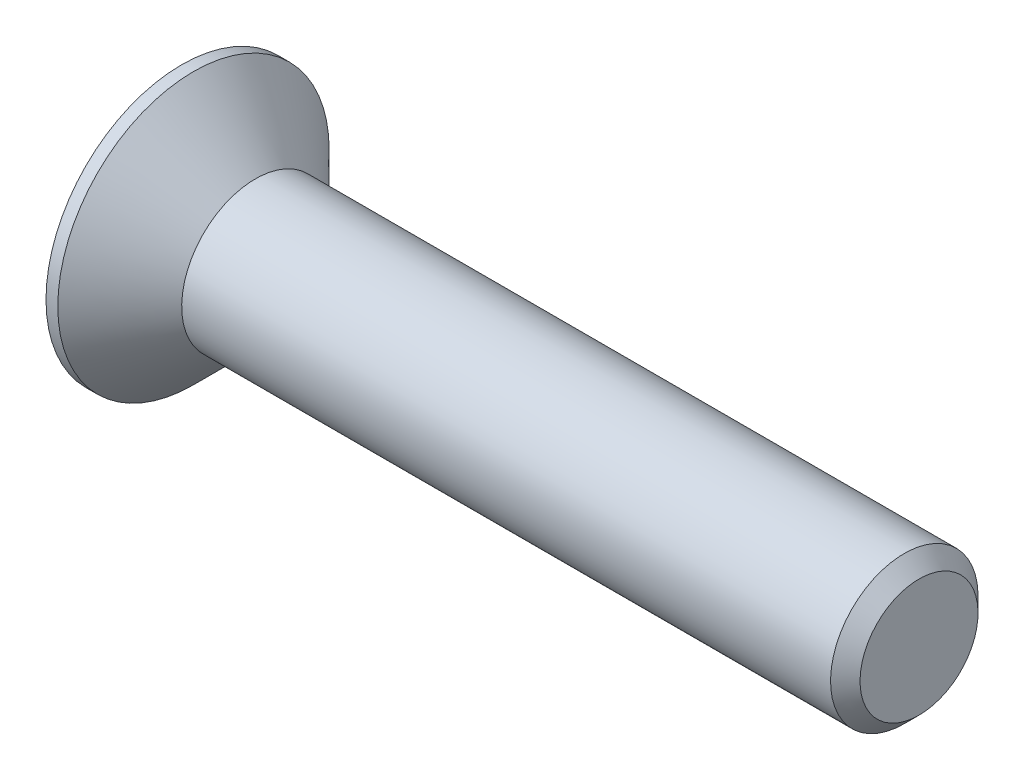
ISO-10303-21;
HEADER;
FILE_DESCRIPTION(('STEP AP214'),'2;1');
FILE_NAME('part.step','',(''),(''),'','','');
FILE_SCHEMA(('AUTOMOTIVE_DESIGN { 1 0 10303 214 1 1 1 1 }'));
ENDSEC;
DATA;
#1=APPLICATION_CONTEXT('core data for automotive mechanical design processes');
#2=APPLICATION_PROTOCOL_DEFINITION('international standard','automotive_design',2000,#1);
#3=PRODUCT_CONTEXT('',#1,'mechanical');
#4=PRODUCT('Part','Part','',(#3));
#5=PRODUCT_RELATED_PRODUCT_CATEGORY('part','',(#4));
#6=PRODUCT_DEFINITION_FORMATION('','',#4);
#7=PRODUCT_DEFINITION_CONTEXT('part definition',#1,'design');
#8=PRODUCT_DEFINITION('design','',#6,#7);
#9=PRODUCT_DEFINITION_SHAPE('','',#8);
#10=(LENGTH_UNIT() NAMED_UNIT(*) SI_UNIT(.MILLI.,.METRE.));
#11=(NAMED_UNIT(*) PLANE_ANGLE_UNIT() SI_UNIT($,.RADIAN.));
#12=(NAMED_UNIT(*) SI_UNIT($,.STERADIAN.) SOLID_ANGLE_UNIT());
#13=UNCERTAINTY_MEASURE_WITH_UNIT(LENGTH_MEASURE(1.E-05),#10,'distance_accuracy_value','');
#14=(GEOMETRIC_REPRESENTATION_CONTEXT(3) GLOBAL_UNCERTAINTY_ASSIGNED_CONTEXT((#13)) GLOBAL_UNIT_ASSIGNED_CONTEXT((#10,
#11,#12)) REPRESENTATION_CONTEXT('',''));
#15=CARTESIAN_POINT('',(0.,0.,0.));
#16=DIRECTION('',(0.,0.,1.));
#17=DIRECTION('',(1.,0.,0.));
#18=AXIS2_PLACEMENT_3D('',#15,#16,#17);
#19=CARTESIAN_POINT('',(0.,0.,0.));
#20=DIRECTION('',(-1.,0.,0.));
#21=DIRECTION('',(0.,-1.,0.));
#22=AXIS2_PLACEMENT_3D('',#19,#20,#21);
#23=CONICAL_SURFACE('',#22,2.5,0.78539816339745);
#24=CARTESIAN_POINT('',(-2.09999999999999,0.,0.));
#25=DIRECTION('',(-1.,0.,0.));
#26=DIRECTION('',(0.,-1.,0.));
#27=AXIS2_PLACEMENT_3D('',#24,#25,#26);
#28=CIRCLE('',#27,4.6);
#29=CARTESIAN_POINT('',(-2.09999999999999,-4.6,0.));
#30=VERTEX_POINT('',#29);
#31=EDGE_CURVE('E189',#30,#30,#28,.T.);
#32=ORIENTED_EDGE('',*,*,#31,.F.);
#33=EDGE_LOOP('',(#32));
#34=FACE_BOUND('',#33,.T.);
#35=CARTESIAN_POINT('',(0.,0.,0.));
#36=DIRECTION('',(-1.,0.,0.));
#37=DIRECTION('',(0.,-1.,0.));
#38=AXIS2_PLACEMENT_3D('',#35,#36,#37);
#39=CIRCLE('',#38,2.5);
#40=CARTESIAN_POINT('',(0.,-2.5,0.));
#41=VERTEX_POINT('',#40);
#42=EDGE_CURVE('E212',#41,#41,#39,.T.);
#43=ORIENTED_EDGE('',*,*,#42,.T.);
#44=EDGE_LOOP('',(#43));
#45=FACE_BOUND('',#44,.T.);
#46=ADVANCED_FACE('F33',(#34,#45),#23,.T.);
#47=CARTESIAN_POINT('',(-2.5,0.,0.));
#48=DIRECTION('',(-1.,0.,0.));
#49=DIRECTION('',(0.,-1.,0.));
#50=AXIS2_PLACEMENT_3D('',#47,#48,#49);
#51=CYLINDRICAL_SURFACE('',#50,2.5);
#52=CARTESIAN_POINT('',(22.,0.,0.));
#53=DIRECTION('',(-1.,0.,0.));
#54=DIRECTION('',(0.,-1.,0.));
#55=AXIS2_PLACEMENT_3D('',#52,#53,#54);
#56=CIRCLE('',#55,2.5);
#57=CARTESIAN_POINT('',(22.,-2.5,0.));
#58=VERTEX_POINT('',#57);
#59=EDGE_CURVE('E41',#58,#58,#56,.T.);
#60=ORIENTED_EDGE('',*,*,#59,.T.);
#61=EDGE_LOOP('',(#60));
#62=FACE_BOUND('',#61,.T.);
#63=ORIENTED_EDGE('',*,*,#42,.F.);
#64=EDGE_LOOP('',(#63));
#65=FACE_BOUND('',#64,.T.);
#66=ADVANCED_FACE('F217',(#62,#65),#51,.T.);
#67=CARTESIAN_POINT('',(22.5,0.,0.));
#68=DIRECTION('',(-1.,0.,0.));
#69=DIRECTION('',(0.,-1.,0.));
#70=AXIS2_PLACEMENT_3D('',#67,#68,#69);
#71=PLANE('',#70);
#72=CARTESIAN_POINT('',(22.5,0.,0.));
#73=DIRECTION('',(-1.,0.,0.));
#74=DIRECTION('',(0.,-1.,0.));
#75=AXIS2_PLACEMENT_3D('',#72,#73,#74);
#76=CIRCLE('',#75,1.99999999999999);
#77=CARTESIAN_POINT('',(22.5,-1.99999999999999,0.));
#78=VERTEX_POINT('',#77);
#79=EDGE_CURVE('E11',#78,#78,#76,.F.);
#80=ORIENTED_EDGE('',*,*,#79,.T.);
#81=EDGE_LOOP('',(#80));
#82=FACE_BOUND('',#81,.T.);
#83=ADVANCED_FACE('F239',(#82),#71,.F.);
#84=CARTESIAN_POINT('',(-2.5,4.6,0.));
#85=DIRECTION('',(1.,0.,0.));
#86=DIRECTION('',(0.,1.,0.));
#87=AXIS2_PLACEMENT_3D('',#84,#85,#86);
#88=PLANE('',#87);
#89=DIRECTION('',(0.,0.,-1.));
#90=VECTOR('',#89,1.);
#91=CARTESIAN_POINT('',(-2.5,0.575,-2.3));
#92=LINE('',#91,#90);
#93=CARTESIAN_POINT('',(-2.5,0.575,-0.575));
#94=VERTEX_POINT('',#93);
#95=CARTESIAN_POINT('',(-2.5,0.575,-2.3));
#96=VERTEX_POINT('',#95);
#97=EDGE_CURVE('E158',#94,#96,#92,.T.);
#98=ORIENTED_EDGE('',*,*,#97,.F.);
#99=DIRECTION('',(0.,-1.,0.));
#100=VECTOR('',#99,1.);
#101=CARTESIAN_POINT('',(-2.5,0.575,-0.575));
#102=LINE('',#101,#100);
#103=CARTESIAN_POINT('',(-2.5,2.3,-0.575));
#104=VERTEX_POINT('',#103);
#105=EDGE_CURVE('E48',#104,#94,#102,.T.);
#106=ORIENTED_EDGE('',*,*,#105,.F.);
#107=DIRECTION('',(0.,0.,-1.));
#108=VECTOR('',#107,1.);
#109=CARTESIAN_POINT('',(-2.5,2.3,-0.575));
#110=LINE('',#109,#108);
#111=CARTESIAN_POINT('',(-2.5,2.3,0.575));
#112=VERTEX_POINT('',#111);
#113=EDGE_CURVE('E185',#112,#104,#110,.T.);
#114=ORIENTED_EDGE('',*,*,#113,.F.);
#115=DIRECTION('',(0.,1.,0.));
#116=VECTOR('',#115,1.);
#117=CARTESIAN_POINT('',(-2.5,2.3,0.575));
#118=LINE('',#117,#116);
#119=CARTESIAN_POINT('',(-2.5,0.575,0.575));
#120=VERTEX_POINT('',#119);
#121=EDGE_CURVE('E183',#120,#112,#118,.T.);
#122=ORIENTED_EDGE('',*,*,#121,.F.);
#123=DIRECTION('',(0.,0.,-1.));
#124=VECTOR('',#123,1.);
#125=CARTESIAN_POINT('',(-2.5,0.575,0.575));
#126=LINE('',#125,#124);
#127=CARTESIAN_POINT('',(-2.5,0.575,2.3));
#128=VERTEX_POINT('',#127);
#129=EDGE_CURVE('E132',#128,#120,#126,.T.);
#130=ORIENTED_EDGE('',*,*,#129,.F.);
#131=DIRECTION('',(0.,1.,0.));
#132=VECTOR('',#131,1.);
#133=CARTESIAN_POINT('',(-2.5,0.575,2.3));
#134=LINE('',#133,#132);
#135=CARTESIAN_POINT('',(-2.5,-0.575,2.3));
#136=VERTEX_POINT('',#135);
#137=EDGE_CURVE('E179',#136,#128,#134,.T.);
#138=ORIENTED_EDGE('',*,*,#137,.F.);
#139=DIRECTION('',(0.,0.,1.));
#140=VECTOR('',#139,1.);
#141=CARTESIAN_POINT('',(-2.5,-0.575,2.3));
#142=LINE('',#141,#140);
#143=CARTESIAN_POINT('',(-2.5,-0.575,0.575));
#144=VERTEX_POINT('',#143);
#145=EDGE_CURVE('E176',#144,#136,#142,.T.);
#146=ORIENTED_EDGE('',*,*,#145,.F.);
#147=DIRECTION('',(0.,1.,0.));
#148=VECTOR('',#147,1.);
#149=CARTESIAN_POINT('',(-2.5,-0.575,0.575));
#150=LINE('',#149,#148);
#151=CARTESIAN_POINT('',(-2.5,-2.3,0.575));
#152=VERTEX_POINT('',#151);
#153=EDGE_CURVE('E173',#152,#144,#150,.T.);
#154=ORIENTED_EDGE('',*,*,#153,.F.);
#155=DIRECTION('',(0.,0.,1.));
#156=VECTOR('',#155,1.);
#157=CARTESIAN_POINT('',(-2.5,-2.3,0.575));
#158=LINE('',#157,#156);
#159=CARTESIAN_POINT('',(-2.5,-2.3,-0.575));
#160=VERTEX_POINT('',#159);
#161=EDGE_CURVE('E170',#160,#152,#158,.T.);
#162=ORIENTED_EDGE('',*,*,#161,.F.);
#163=DIRECTION('',(0.,-1.,0.));
#164=VECTOR('',#163,1.);
#165=CARTESIAN_POINT('',(-2.5,-2.3,-0.575));
#166=LINE('',#165,#164);
#167=CARTESIAN_POINT('',(-2.5,-0.575,-0.575));
#168=VERTEX_POINT('',#167);
#169=EDGE_CURVE('E167',#168,#160,#166,.T.);
#170=ORIENTED_EDGE('',*,*,#169,.F.);
#171=DIRECTION('',(0.,0.,1.));
#172=VECTOR('',#171,1.);
#173=CARTESIAN_POINT('',(-2.5,-0.575,-0.575));
#174=LINE('',#173,#172);
#175=CARTESIAN_POINT('',(-2.5,-0.575,-2.3));
#176=VERTEX_POINT('',#175);
#177=EDGE_CURVE('E164',#176,#168,#174,.T.);
#178=ORIENTED_EDGE('',*,*,#177,.F.);
#179=DIRECTION('',(0.,-1.,0.));
#180=VECTOR('',#179,1.);
#181=CARTESIAN_POINT('',(-2.5,-0.575,-2.3));
#182=LINE('',#181,#180);
#183=EDGE_CURVE('E161',#96,#176,#182,.T.);
#184=ORIENTED_EDGE('',*,*,#183,.F.);
#185=EDGE_LOOP('',(#98,#106,#114,#122,#130,#138,#146,#154,#162,#170,#178,#184));
#186=FACE_BOUND('',#185,.T.);
#187=CARTESIAN_POINT('',(-2.5,0.,0.));
#188=DIRECTION('',(-1.,0.,0.));
#189=DIRECTION('',(0.,-1.,0.));
#190=AXIS2_PLACEMENT_3D('',#187,#188,#189);
#191=CIRCLE('',#190,4.6);
#192=CARTESIAN_POINT('',(-2.5,-4.6,0.));
#193=VERTEX_POINT('',#192);
#194=EDGE_CURVE('E209',#193,#193,#191,.T.);
#195=ORIENTED_EDGE('',*,*,#194,.T.);
#196=EDGE_LOOP('',(#195));
#197=FACE_BOUND('',#196,.T.);
#198=ADVANCED_FACE('F230',(#186,#197),#88,.F.);
#199=CARTESIAN_POINT('',(-2.5,0.,0.));
#200=DIRECTION('',(-1.,0.,0.));
#201=DIRECTION('',(0.,-1.,0.));
#202=AXIS2_PLACEMENT_3D('',#199,#200,#201);
#203=CYLINDRICAL_SURFACE('',#202,4.6);
#204=ORIENTED_EDGE('',*,*,#194,.F.);
#205=EDGE_LOOP('',(#204));
#206=FACE_BOUND('',#205,.T.);
#207=ORIENTED_EDGE('',*,*,#31,.T.);
#208=EDGE_LOOP('',(#207));
#209=FACE_BOUND('',#208,.T.);
#210=ADVANCED_FACE('F222',(#206,#209),#203,.T.);
#211=CARTESIAN_POINT('',(22.,0.,0.));
#212=DIRECTION('',(-1.,0.,0.));
#213=DIRECTION('',(0.,-1.,0.));
#214=AXIS2_PLACEMENT_3D('',#211,#212,#213);
#215=CONICAL_SURFACE('',#214,2.5,0.785398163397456);
#216=ORIENTED_EDGE('',*,*,#79,.F.);
#217=EDGE_LOOP('',(#216));
#218=FACE_BOUND('',#217,.T.);
#219=ORIENTED_EDGE('',*,*,#59,.F.);
#220=EDGE_LOOP('',(#219));
#221=FACE_BOUND('',#220,.T.);
#222=ADVANCED_FACE('F35',(#218,#221),#215,.T.);
#223=CARTESIAN_POINT('',(-0.4,0.575,-0.575));
#224=DIRECTION('',(0.,0.,-1.));
#225=DIRECTION('',(-1.,0.,0.));
#226=AXIS2_PLACEMENT_3D('',#223,#224,#225);
#227=PLANE('',#226);
#228=ORIENTED_EDGE('',*,*,#105,.T.);
#229=DIRECTION('',(-1.,0.,0.));
#230=VECTOR('',#229,1.);
#231=CARTESIAN_POINT('',(-0.4,0.575,-0.575));
#232=LINE('',#231,#230);
#233=CARTESIAN_POINT('',(-0.4,0.575,-0.575));
#234=VERTEX_POINT('',#233);
#235=EDGE_CURVE('E96',#234,#94,#232,.T.);
#236=ORIENTED_EDGE('',*,*,#235,.F.);
#237=DIRECTION('',(0.,-1.,0.));
#238=VECTOR('',#237,1.);
#239=CARTESIAN_POINT('',(-0.4,0.575,-0.575));
#240=LINE('',#239,#238);
#241=CARTESIAN_POINT('',(-0.4,2.3,-0.575));
#242=VERTEX_POINT('',#241);
#243=EDGE_CURVE('E187',#242,#234,#240,.T.);
#244=ORIENTED_EDGE('',*,*,#243,.F.);
#245=DIRECTION('',(-1.,0.,0.));
#246=VECTOR('',#245,1.);
#247=CARTESIAN_POINT('',(-0.4,2.3,-0.575));
#248=LINE('',#247,#246);
#249=EDGE_CURVE('E56',#242,#104,#248,.T.);
#250=ORIENTED_EDGE('',*,*,#249,.T.);
#251=EDGE_LOOP('',(#228,#236,#244,#250));
#252=FACE_BOUND('',#251,.T.);
#253=ADVANCED_FACE('F221',(#252),#227,.F.);
#254=CARTESIAN_POINT('',(-0.4,2.3,-0.575));
#255=DIRECTION('',(0.,1.,0.));
#256=DIRECTION('',(-1.,0.,0.));
#257=AXIS2_PLACEMENT_3D('',#254,#255,#256);
#258=PLANE('',#257);
#259=ORIENTED_EDGE('',*,*,#113,.T.);
#260=ORIENTED_EDGE('',*,*,#249,.F.);
#261=DIRECTION('',(0.,0.,-1.));
#262=VECTOR('',#261,1.);
#263=CARTESIAN_POINT('',(-0.4,2.3,-0.575));
#264=LINE('',#263,#262);
#265=CARTESIAN_POINT('',(-0.4,2.3,0.575));
#266=VERTEX_POINT('',#265);
#267=EDGE_CURVE('E144',#266,#242,#264,.T.);
#268=ORIENTED_EDGE('',*,*,#267,.F.);
#269=DIRECTION('',(-1.,0.,0.));
#270=VECTOR('',#269,1.);
#271=CARTESIAN_POINT('',(-0.4,2.3,0.575));
#272=LINE('',#271,#270);
#273=EDGE_CURVE('E136',#266,#112,#272,.T.);
#274=ORIENTED_EDGE('',*,*,#273,.T.);
#275=EDGE_LOOP('',(#259,#260,#268,#274));
#276=FACE_BOUND('',#275,.T.);
#277=ADVANCED_FACE('F228',(#276),#258,.F.);
#278=CARTESIAN_POINT('',(-0.4,2.3,0.575));
#279=DIRECTION('',(0.,0.,1.));
#280=DIRECTION('',(1.,0.,0.));
#281=AXIS2_PLACEMENT_3D('',#278,#279,#280);
#282=PLANE('',#281);
#283=ORIENTED_EDGE('',*,*,#121,.T.);
#284=ORIENTED_EDGE('',*,*,#273,.F.);
#285=DIRECTION('',(0.,1.,0.));
#286=VECTOR('',#285,1.);
#287=CARTESIAN_POINT('',(-0.4,2.3,0.575));
#288=LINE('',#287,#286);
#289=CARTESIAN_POINT('',(-0.4,0.575,0.575));
#290=VERTEX_POINT('',#289);
#291=EDGE_CURVE('E140',#290,#266,#288,.T.);
#292=ORIENTED_EDGE('',*,*,#291,.F.);
#293=DIRECTION('',(-1.,0.,0.));
#294=VECTOR('',#293,1.);
#295=CARTESIAN_POINT('',(-0.4,0.575,0.575));
#296=LINE('',#295,#294);
#297=EDGE_CURVE('E125',#290,#120,#296,.T.);
#298=ORIENTED_EDGE('',*,*,#297,.T.);
#299=EDGE_LOOP('',(#283,#284,#292,#298));
#300=FACE_BOUND('',#299,.T.);
#301=ADVANCED_FACE('F141',(#300),#282,.F.);
#302=CARTESIAN_POINT('',(-0.4,0.575,0.575));
#303=DIRECTION('',(0.,1.,0.));
#304=DIRECTION('',(-1.,0.,0.));
#305=AXIS2_PLACEMENT_3D('',#302,#303,#304);
#306=PLANE('',#305);
#307=ORIENTED_EDGE('',*,*,#129,.T.);
#308=ORIENTED_EDGE('',*,*,#297,.F.);
#309=DIRECTION('',(0.,0.,-1.));
#310=VECTOR('',#309,1.);
#311=CARTESIAN_POINT('',(-0.4,0.575,0.575));
#312=LINE('',#311,#310);
#313=CARTESIAN_POINT('',(-0.4,0.575,2.3));
#314=VERTEX_POINT('',#313);
#315=EDGE_CURVE('E129',#314,#290,#312,.T.);
#316=ORIENTED_EDGE('',*,*,#315,.F.);
#317=DIRECTION('',(-1.,0.,0.));
#318=VECTOR('',#317,1.);
#319=CARTESIAN_POINT('',(-0.4,0.575,2.3));
#320=LINE('',#319,#318);
#321=EDGE_CURVE('E137',#314,#128,#320,.T.);
#322=ORIENTED_EDGE('',*,*,#321,.T.);
#323=EDGE_LOOP('',(#307,#308,#316,#322));
#324=FACE_BOUND('',#323,.T.);
#325=ADVANCED_FACE('F127',(#324),#306,.F.);
#326=CARTESIAN_POINT('',(-0.4,0.575,2.3));
#327=DIRECTION('',(0.,0.,1.));
#328=DIRECTION('',(1.,0.,0.));
#329=AXIS2_PLACEMENT_3D('',#326,#327,#328);
#330=PLANE('',#329);
#331=ORIENTED_EDGE('',*,*,#137,.T.);
#332=ORIENTED_EDGE('',*,*,#321,.F.);
#333=DIRECTION('',(0.,1.,0.));
#334=VECTOR('',#333,1.);
#335=CARTESIAN_POINT('',(-0.4,0.575,2.3));
#336=LINE('',#335,#334);
#337=CARTESIAN_POINT('',(-0.4,-0.575,2.3));
#338=VERTEX_POINT('',#337);
#339=EDGE_CURVE('E150',#338,#314,#336,.T.);
#340=ORIENTED_EDGE('',*,*,#339,.F.);
#341=DIRECTION('',(-1.,0.,0.));
#342=VECTOR('',#341,1.);
#343=CARTESIAN_POINT('',(-0.4,-0.575,2.3));
#344=LINE('',#343,#342);
#345=EDGE_CURVE('E192',#338,#136,#344,.T.);
#346=ORIENTED_EDGE('',*,*,#345,.T.);
#347=EDGE_LOOP('',(#331,#332,#340,#346));
#348=FACE_BOUND('',#347,.T.);
#349=ADVANCED_FACE('F277',(#348),#330,.F.);
#350=CARTESIAN_POINT('',(-0.4,-0.575,2.3));
#351=DIRECTION('',(0.,-1.,0.));
#352=DIRECTION('',(1.,0.,0.));
#353=AXIS2_PLACEMENT_3D('',#350,#351,#352);
#354=PLANE('',#353);
#355=ORIENTED_EDGE('',*,*,#145,.T.);
#356=ORIENTED_EDGE('',*,*,#345,.F.);
#357=DIRECTION('',(0.,0.,1.));
#358=VECTOR('',#357,1.);
#359=CARTESIAN_POINT('',(-0.4,-0.575,2.3));
#360=LINE('',#359,#358);
#361=CARTESIAN_POINT('',(-0.4,-0.575,0.575));
#362=VERTEX_POINT('',#361);
#363=EDGE_CURVE('E152',#362,#338,#360,.T.);
#364=ORIENTED_EDGE('',*,*,#363,.F.);
#365=DIRECTION('',(-1.,0.,0.));
#366=VECTOR('',#365,1.);
#367=CARTESIAN_POINT('',(-0.4,-0.575,0.575));
#368=LINE('',#367,#366);
#369=EDGE_CURVE('E194',#362,#144,#368,.T.);
#370=ORIENTED_EDGE('',*,*,#369,.T.);
#371=EDGE_LOOP('',(#355,#356,#364,#370));
#372=FACE_BOUND('',#371,.T.);
#373=ADVANCED_FACE('F273',(#372),#354,.F.);
#374=CARTESIAN_POINT('',(-0.4,-0.575,0.575));
#375=DIRECTION('',(0.,0.,1.));
#376=DIRECTION('',(1.,0.,0.));
#377=AXIS2_PLACEMENT_3D('',#374,#375,#376);
#378=PLANE('',#377);
#379=ORIENTED_EDGE('',*,*,#153,.T.);
#380=ORIENTED_EDGE('',*,*,#369,.F.);
#381=DIRECTION('',(0.,1.,0.));
#382=VECTOR('',#381,1.);
#383=CARTESIAN_POINT('',(-0.4,-0.575,0.575));
#384=LINE('',#383,#382);
#385=CARTESIAN_POINT('',(-0.4,-2.3,0.575));
#386=VERTEX_POINT('',#385);
#387=EDGE_CURVE('E422',#386,#362,#384,.T.);
#388=ORIENTED_EDGE('',*,*,#387,.F.);
#389=DIRECTION('',(-1.,0.,0.));
#390=VECTOR('',#389,1.);
#391=CARTESIAN_POINT('',(-0.4,-2.3,0.575));
#392=LINE('',#391,#390);
#393=EDGE_CURVE('E196',#386,#152,#392,.T.);
#394=ORIENTED_EDGE('',*,*,#393,.T.);
#395=EDGE_LOOP('',(#379,#380,#388,#394));
#396=FACE_BOUND('',#395,.T.);
#397=ADVANCED_FACE('F269',(#396),#378,.F.);
#398=CARTESIAN_POINT('',(-0.4,-2.3,0.575));
#399=DIRECTION('',(0.,-1.,0.));
#400=DIRECTION('',(1.,0.,0.));
#401=AXIS2_PLACEMENT_3D('',#398,#399,#400);
#402=PLANE('',#401);
#403=ORIENTED_EDGE('',*,*,#161,.T.);
#404=ORIENTED_EDGE('',*,*,#393,.F.);
#405=DIRECTION('',(0.,0.,1.));
#406=VECTOR('',#405,1.);
#407=CARTESIAN_POINT('',(-0.4,-2.3,0.575));
#408=LINE('',#407,#406);
#409=CARTESIAN_POINT('',(-0.4,-2.3,-0.575));
#410=VERTEX_POINT('',#409);
#411=EDGE_CURVE('E419',#410,#386,#408,.T.);
#412=ORIENTED_EDGE('',*,*,#411,.F.);
#413=DIRECTION('',(-1.,0.,0.));
#414=VECTOR('',#413,1.);
#415=CARTESIAN_POINT('',(-0.4,-2.3,-0.575));
#416=LINE('',#415,#414);
#417=EDGE_CURVE('E198',#410,#160,#416,.T.);
#418=ORIENTED_EDGE('',*,*,#417,.T.);
#419=EDGE_LOOP('',(#403,#404,#412,#418));
#420=FACE_BOUND('',#419,.T.);
#421=ADVANCED_FACE('F265',(#420),#402,.F.);
#422=CARTESIAN_POINT('',(-0.4,-2.3,-0.575));
#423=DIRECTION('',(0.,0.,-1.));
#424=DIRECTION('',(-1.,0.,0.));
#425=AXIS2_PLACEMENT_3D('',#422,#423,#424);
#426=PLANE('',#425);
#427=ORIENTED_EDGE('',*,*,#169,.T.);
#428=ORIENTED_EDGE('',*,*,#417,.F.);
#429=DIRECTION('',(0.,-1.,0.));
#430=VECTOR('',#429,1.);
#431=CARTESIAN_POINT('',(-0.4,-2.3,-0.575));
#432=LINE('',#431,#430);
#433=CARTESIAN_POINT('',(-0.4,-0.575,-0.575));
#434=VERTEX_POINT('',#433);
#435=EDGE_CURVE('E416',#434,#410,#432,.T.);
#436=ORIENTED_EDGE('',*,*,#435,.F.);
#437=DIRECTION('',(-1.,0.,0.));
#438=VECTOR('',#437,1.);
#439=CARTESIAN_POINT('',(-0.4,-0.575,-0.575));
#440=LINE('',#439,#438);
#441=EDGE_CURVE('E200',#434,#168,#440,.T.);
#442=ORIENTED_EDGE('',*,*,#441,.T.);
#443=EDGE_LOOP('',(#427,#428,#436,#442));
#444=FACE_BOUND('',#443,.T.);
#445=ADVANCED_FACE('F261',(#444),#426,.F.);
#446=CARTESIAN_POINT('',(-0.4,-0.575,-0.575));
#447=DIRECTION('',(0.,-1.,0.));
#448=DIRECTION('',(1.,0.,0.));
#449=AXIS2_PLACEMENT_3D('',#446,#447,#448);
#450=PLANE('',#449);
#451=ORIENTED_EDGE('',*,*,#177,.T.);
#452=ORIENTED_EDGE('',*,*,#441,.F.);
#453=DIRECTION('',(0.,0.,1.));
#454=VECTOR('',#453,1.);
#455=CARTESIAN_POINT('',(-0.4,-0.575,-0.575));
#456=LINE('',#455,#454);
#457=CARTESIAN_POINT('',(-0.4,-0.575,-2.3));
#458=VERTEX_POINT('',#457);
#459=EDGE_CURVE('E413',#458,#434,#456,.T.);
#460=ORIENTED_EDGE('',*,*,#459,.F.);
#461=DIRECTION('',(-1.,0.,0.));
#462=VECTOR('',#461,1.);
#463=CARTESIAN_POINT('',(-0.4,-0.575,-2.3));
#464=LINE('',#463,#462);
#465=EDGE_CURVE('E202',#458,#176,#464,.T.);
#466=ORIENTED_EDGE('',*,*,#465,.T.);
#467=EDGE_LOOP('',(#451,#452,#460,#466));
#468=FACE_BOUND('',#467,.T.);
#469=ADVANCED_FACE('F257',(#468),#450,.F.);
#470=CARTESIAN_POINT('',(-0.4,-0.575,-2.3));
#471=DIRECTION('',(0.,0.,-1.));
#472=DIRECTION('',(-1.,0.,0.));
#473=AXIS2_PLACEMENT_3D('',#470,#471,#472);
#474=PLANE('',#473);
#475=ORIENTED_EDGE('',*,*,#183,.T.);
#476=ORIENTED_EDGE('',*,*,#465,.F.);
#477=DIRECTION('',(0.,-1.,0.));
#478=VECTOR('',#477,1.);
#479=CARTESIAN_POINT('',(-0.4,-0.575,-2.3));
#480=LINE('',#479,#478);
#481=CARTESIAN_POINT('',(-0.4,0.575,-2.3));
#482=VERTEX_POINT('',#481);
#483=EDGE_CURVE('E408',#482,#458,#480,.T.);
#484=ORIENTED_EDGE('',*,*,#483,.F.);
#485=DIRECTION('',(-1.,0.,0.));
#486=VECTOR('',#485,1.);
#487=CARTESIAN_POINT('',(-0.4,0.575,-2.3));
#488=LINE('',#487,#486);
#489=EDGE_CURVE('E204',#482,#96,#488,.T.);
#490=ORIENTED_EDGE('',*,*,#489,.T.);
#491=EDGE_LOOP('',(#475,#476,#484,#490));
#492=FACE_BOUND('',#491,.T.);
#493=ADVANCED_FACE('F253',(#492),#474,.F.);
#494=CARTESIAN_POINT('',(-0.4,0.575,-2.3));
#495=DIRECTION('',(0.,1.,0.));
#496=DIRECTION('',(-1.,0.,0.));
#497=AXIS2_PLACEMENT_3D('',#494,#495,#496);
#498=PLANE('',#497);
#499=ORIENTED_EDGE('',*,*,#97,.T.);
#500=ORIENTED_EDGE('',*,*,#489,.F.);
#501=DIRECTION('',(0.,0.,-1.));
#502=VECTOR('',#501,1.);
#503=CARTESIAN_POINT('',(-0.4,0.575,-2.3));
#504=LINE('',#503,#502);
#505=EDGE_CURVE('E406',#234,#482,#504,.T.);
#506=ORIENTED_EDGE('',*,*,#505,.F.);
#507=ORIENTED_EDGE('',*,*,#235,.T.);
#508=EDGE_LOOP('',(#499,#500,#506,#507));
#509=FACE_BOUND('',#508,.T.);
#510=ADVANCED_FACE('F250',(#509),#498,.F.);
#511=CARTESIAN_POINT('',(-0.4,0.,0.));
#512=DIRECTION('',(1.,0.,0.));
#513=DIRECTION('',(0.,0.,-1.));
#514=AXIS2_PLACEMENT_3D('',#511,#512,#513);
#515=PLANE('',#514);
#516=ORIENTED_EDGE('',*,*,#243,.T.);
#517=ORIENTED_EDGE('',*,*,#505,.T.);
#518=ORIENTED_EDGE('',*,*,#483,.T.);
#519=ORIENTED_EDGE('',*,*,#459,.T.);
#520=ORIENTED_EDGE('',*,*,#435,.T.);
#521=ORIENTED_EDGE('',*,*,#411,.T.);
#522=ORIENTED_EDGE('',*,*,#387,.T.);
#523=ORIENTED_EDGE('',*,*,#363,.T.);
#524=ORIENTED_EDGE('',*,*,#339,.T.);
#525=ORIENTED_EDGE('',*,*,#315,.T.);
#526=ORIENTED_EDGE('',*,*,#291,.T.);
#527=ORIENTED_EDGE('',*,*,#267,.T.);
#528=EDGE_LOOP('',(#516,#517,#518,#519,#520,#521,#522,#523,#524,#525,#526,#527));
#529=FACE_BOUND('',#528,.T.);
#530=ADVANCED_FACE('F147',(#529),#515,.F.);
#531=CLOSED_SHELL('',(#46,#66,#83,#198,#210,#222,#253,#277,#301,#325,#349,#373,#397,#421,#445,
#469,#493,#510,#530));
#532=MANIFOLD_SOLID_BREP('B2',#531);
#533=ADVANCED_BREP_SHAPE_REPRESENTATION('',(#18,#532),#14);
#534=SHAPE_DEFINITION_REPRESENTATION(#9,#533);
ENDSEC;
END-ISO-10303-21;
